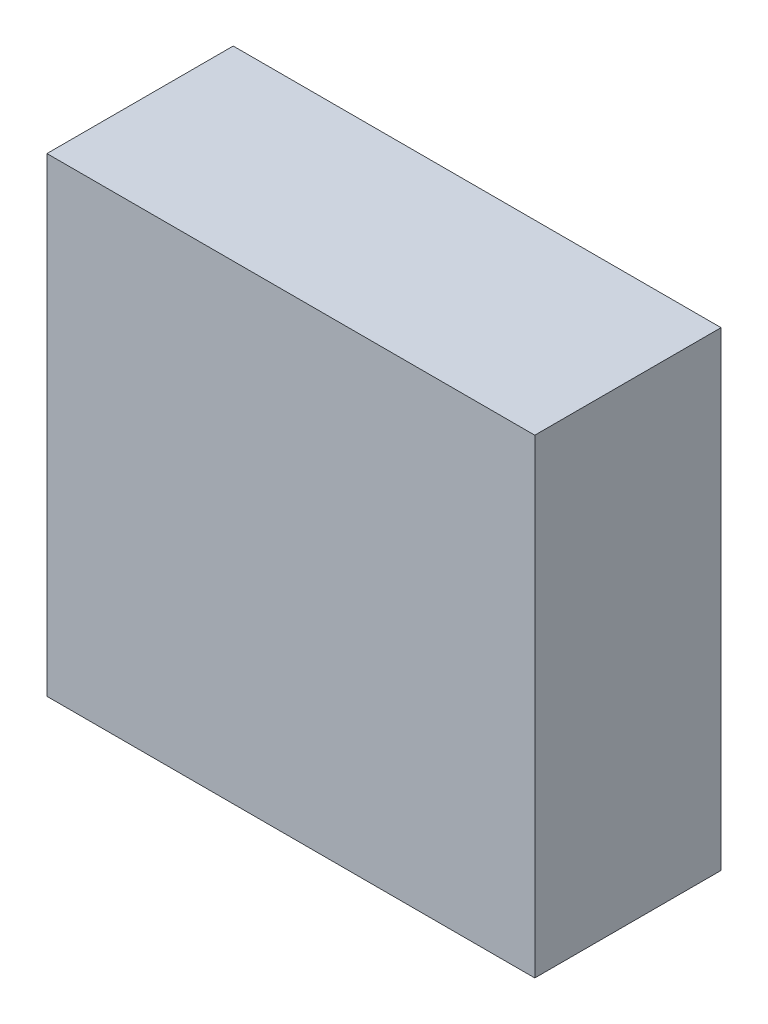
ISO-10303-21;
HEADER;
FILE_DESCRIPTION(('STEP AP214'),'2;1');
FILE_NAME('part.step','',(''),(''),'','','');
FILE_SCHEMA(('AUTOMOTIVE_DESIGN { 1 0 10303 214 1 1 1 1 }'));
ENDSEC;
DATA;
#1=APPLICATION_CONTEXT('core data for automotive mechanical design processes');
#2=APPLICATION_PROTOCOL_DEFINITION('international standard','automotive_design',2000,#1);
#3=PRODUCT_CONTEXT('',#1,'mechanical');
#4=PRODUCT('Part','Part','',(#3));
#5=PRODUCT_RELATED_PRODUCT_CATEGORY('part','',(#4));
#6=PRODUCT_DEFINITION_FORMATION('','',#4);
#7=PRODUCT_DEFINITION_CONTEXT('part definition',#1,'design');
#8=PRODUCT_DEFINITION('design','',#6,#7);
#9=PRODUCT_DEFINITION_SHAPE('','',#8);
#10=(LENGTH_UNIT() NAMED_UNIT(*) SI_UNIT(.MILLI.,.METRE.));
#11=(NAMED_UNIT(*) PLANE_ANGLE_UNIT() SI_UNIT($,.RADIAN.));
#12=(NAMED_UNIT(*) SI_UNIT($,.STERADIAN.) SOLID_ANGLE_UNIT());
#13=UNCERTAINTY_MEASURE_WITH_UNIT(LENGTH_MEASURE(1.E-05),#10,'distance_accuracy_value','');
#14=(GEOMETRIC_REPRESENTATION_CONTEXT(3) GLOBAL_UNCERTAINTY_ASSIGNED_CONTEXT((#13)) GLOBAL_UNIT_ASSIGNED_CONTEXT((#10,
#11,#12)) REPRESENTATION_CONTEXT('',''));
#15=CARTESIAN_POINT('',(0.,0.,0.));
#16=DIRECTION('',(0.,0.,1.));
#17=DIRECTION('',(1.,0.,0.));
#18=AXIS2_PLACEMENT_3D('',#15,#16,#17);
#19=CARTESIAN_POINT('',(2.75000004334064,-2.64999929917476,0.));
#20=DIRECTION('',(1.74845553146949E-07,-0.999999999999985,0.));
#21=DIRECTION('',(-0.999999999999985,-1.74845553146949E-07,0.));
#22=AXIS2_PLACEMENT_3D('',#19,#20,#21);
#23=PLANE('',#22);
#24=DIRECTION('',(0.,0.,1.));
#25=VECTOR('',#24,1.);
#26=CARTESIAN_POINT('',(2.75000004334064,-2.64999929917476,0.));
#27=LINE('',#26,#25);
#28=CARTESIAN_POINT('',(2.75000004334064,-2.64999929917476,0.));
#29=VERTEX_POINT('',#28);
#30=CARTESIAN_POINT('',(2.75000004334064,-2.64999929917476,2.10000088));
#31=VERTEX_POINT('',#30);
#32=EDGE_CURVE('E11',#29,#31,#27,.T.);
#33=ORIENTED_EDGE('',*,*,#32,.T.);
#34=DIRECTION('',(-0.999999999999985,-1.74845553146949E-07,0.));
#35=VECTOR('',#34,1.);
#36=CARTESIAN_POINT('',(2.75000004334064,-2.64999929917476,2.10000088));
#37=LINE('',#36,#35);
#38=CARTESIAN_POINT('',(-2.74999911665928,-2.65000026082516,2.10000088));
#39=VERTEX_POINT('',#38);
#40=EDGE_CURVE('E24',#31,#39,#37,.T.);
#41=ORIENTED_EDGE('',*,*,#40,.T.);
#42=DIRECTION('',(0.,0.,1.));
#43=VECTOR('',#42,1.);
#44=CARTESIAN_POINT('',(-2.74999911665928,-2.65000026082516,0.));
#45=LINE('',#44,#43);
#46=CARTESIAN_POINT('',(-2.74999911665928,-2.65000026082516,0.));
#47=VERTEX_POINT('',#46);
#48=EDGE_CURVE('E84',#47,#39,#45,.T.);
#49=ORIENTED_EDGE('',*,*,#48,.F.);
#50=DIRECTION('',(-0.999999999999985,-1.74845553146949E-07,0.));
#51=VECTOR('',#50,1.);
#52=CARTESIAN_POINT('',(2.75000004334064,-2.64999929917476,0.));
#53=LINE('',#52,#51);
#54=EDGE_CURVE('E82',#29,#47,#53,.T.);
#55=ORIENTED_EDGE('',*,*,#54,.F.);
#56=EDGE_LOOP('',(#33,#41,#49,#55));
#57=FACE_BOUND('',#56,.T.);
#58=ADVANCED_FACE('F17',(#57),#23,.T.);
#59=CARTESIAN_POINT('',(-2.74999911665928,-2.65000026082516,0.));
#60=DIRECTION('',(-0.999999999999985,-1.74845553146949E-07,0.));
#61=DIRECTION('',(-1.74845553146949E-07,0.999999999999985,0.));
#62=AXIS2_PLACEMENT_3D('',#59,#60,#61);
#63=PLANE('',#62);
#64=ORIENTED_EDGE('',*,*,#48,.T.);
#65=DIRECTION('',(-1.74845553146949E-07,0.999999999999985,0.));
#66=VECTOR('',#65,1.);
#67=CARTESIAN_POINT('',(-2.74999911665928,-2.65000026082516,2.10000088));
#68=LINE('',#67,#66);
#69=CARTESIAN_POINT('',(-2.75000004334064,2.64999929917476,2.10000088));
#70=VERTEX_POINT('',#69);
#71=EDGE_CURVE('E80',#39,#70,#68,.T.);
#72=ORIENTED_EDGE('',*,*,#71,.T.);
#73=DIRECTION('',(0.,0.,1.));
#74=VECTOR('',#73,1.);
#75=CARTESIAN_POINT('',(-2.75000004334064,2.64999929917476,0.));
#76=LINE('',#75,#74);
#77=CARTESIAN_POINT('',(-2.75000004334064,2.64999929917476,0.));
#78=VERTEX_POINT('',#77);
#79=EDGE_CURVE('E78',#78,#70,#76,.T.);
#80=ORIENTED_EDGE('',*,*,#79,.F.);
#81=DIRECTION('',(-1.74845553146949E-07,0.999999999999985,0.));
#82=VECTOR('',#81,1.);
#83=CARTESIAN_POINT('',(-2.74999911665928,-2.65000026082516,0.));
#84=LINE('',#83,#82);
#85=EDGE_CURVE('E58',#47,#78,#84,.T.);
#86=ORIENTED_EDGE('',*,*,#85,.F.);
#87=EDGE_LOOP('',(#64,#72,#80,#86));
#88=FACE_BOUND('',#87,.T.);
#89=ADVANCED_FACE('F91',(#88),#63,.T.);
#90=CARTESIAN_POINT('',(-2.75000004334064,2.64999929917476,0.));
#91=DIRECTION('',(-1.74845553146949E-07,0.999999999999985,0.));
#92=DIRECTION('',(0.999999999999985,1.74845553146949E-07,0.));
#93=AXIS2_PLACEMENT_3D('',#90,#91,#92);
#94=PLANE('',#93);
#95=ORIENTED_EDGE('',*,*,#79,.T.);
#96=DIRECTION('',(0.999999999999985,1.74845553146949E-07,0.));
#97=VECTOR('',#96,1.);
#98=CARTESIAN_POINT('',(-2.75000004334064,2.64999929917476,2.10000088));
#99=LINE('',#98,#97);
#100=CARTESIAN_POINT('',(2.74999911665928,2.65000026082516,2.10000088));
#101=VERTEX_POINT('',#100);
#102=EDGE_CURVE('E72',#70,#101,#99,.T.);
#103=ORIENTED_EDGE('',*,*,#102,.T.);
#104=DIRECTION('',(0.,0.,1.));
#105=VECTOR('',#104,1.);
#106=CARTESIAN_POINT('',(2.74999911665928,2.65000026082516,0.));
#107=LINE('',#106,#105);
#108=CARTESIAN_POINT('',(2.74999911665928,2.65000026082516,0.));
#109=VERTEX_POINT('',#108);
#110=EDGE_CURVE('E63',#109,#101,#107,.T.);
#111=ORIENTED_EDGE('',*,*,#110,.F.);
#112=DIRECTION('',(0.999999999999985,1.74845553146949E-07,0.));
#113=VECTOR('',#112,1.);
#114=CARTESIAN_POINT('',(-2.75000004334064,2.64999929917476,0.));
#115=LINE('',#114,#113);
#116=EDGE_CURVE('E54',#78,#109,#115,.T.);
#117=ORIENTED_EDGE('',*,*,#116,.F.);
#118=EDGE_LOOP('',(#95,#103,#111,#117));
#119=FACE_BOUND('',#118,.T.);
#120=ADVANCED_FACE('F70',(#119),#94,.T.);
#121=CARTESIAN_POINT('',(2.74999911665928,2.65000026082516,0.));
#122=DIRECTION('',(0.999999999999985,1.74845553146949E-07,0.));
#123=DIRECTION('',(1.74845553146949E-07,-0.999999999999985,0.));
#124=AXIS2_PLACEMENT_3D('',#121,#122,#123);
#125=PLANE('',#124);
#126=ORIENTED_EDGE('',*,*,#110,.T.);
#127=DIRECTION('',(1.74845553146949E-07,-0.999999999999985,0.));
#128=VECTOR('',#127,1.);
#129=CARTESIAN_POINT('',(2.74999911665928,2.65000026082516,2.10000088));
#130=LINE('',#129,#128);
#131=EDGE_CURVE('E64',#101,#31,#130,.T.);
#132=ORIENTED_EDGE('',*,*,#131,.T.);
#133=ORIENTED_EDGE('',*,*,#32,.F.);
#134=DIRECTION('',(1.74845553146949E-07,-0.999999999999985,0.));
#135=VECTOR('',#134,1.);
#136=CARTESIAN_POINT('',(2.74999911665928,2.65000026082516,0.));
#137=LINE('',#136,#135);
#138=EDGE_CURVE('E56',#109,#29,#137,.T.);
#139=ORIENTED_EDGE('',*,*,#138,.F.);
#140=EDGE_LOOP('',(#126,#132,#133,#139));
#141=FACE_BOUND('',#140,.T.);
#142=ADVANCED_FACE('F67',(#141),#125,.T.);
#143=CARTESIAN_POINT('',(2.75000004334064,-2.64999929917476,0.));
#144=DIRECTION('',(0.,0.,1.));
#145=DIRECTION('',(0.999999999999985,1.74845553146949E-07,0.));
#146=AXIS2_PLACEMENT_3D('',#143,#144,#145);
#147=PLANE('',#146);
#148=ORIENTED_EDGE('',*,*,#54,.T.);
#149=ORIENTED_EDGE('',*,*,#85,.T.);
#150=ORIENTED_EDGE('',*,*,#116,.T.);
#151=ORIENTED_EDGE('',*,*,#138,.T.);
#152=EDGE_LOOP('',(#148,#149,#150,#151));
#153=FACE_BOUND('',#152,.T.);
#154=ADVANCED_FACE('F55',(#153),#147,.F.);
#155=CARTESIAN_POINT('',(2.75000004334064,-2.64999929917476,2.10000088));
#156=DIRECTION('',(0.,0.,1.));
#157=DIRECTION('',(0.999999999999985,1.74845553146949E-07,0.));
#158=AXIS2_PLACEMENT_3D('',#155,#156,#157);
#159=PLANE('',#158);
#160=ORIENTED_EDGE('',*,*,#131,.F.);
#161=ORIENTED_EDGE('',*,*,#102,.F.);
#162=ORIENTED_EDGE('',*,*,#71,.F.);
#163=ORIENTED_EDGE('',*,*,#40,.F.);
#164=EDGE_LOOP('',(#160,#161,#162,#163));
#165=FACE_BOUND('',#164,.T.);
#166=ADVANCED_FACE('F89',(#165),#159,.T.);
#167=CLOSED_SHELL('',(#58,#89,#120,#142,#154,#166));
#168=MANIFOLD_SOLID_BREP('B1',#167);
#169=ADVANCED_BREP_SHAPE_REPRESENTATION('',(#18,#168),#14);
#170=SHAPE_DEFINITION_REPRESENTATION(#9,#169);
ENDSEC;
END-ISO-10303-21;
